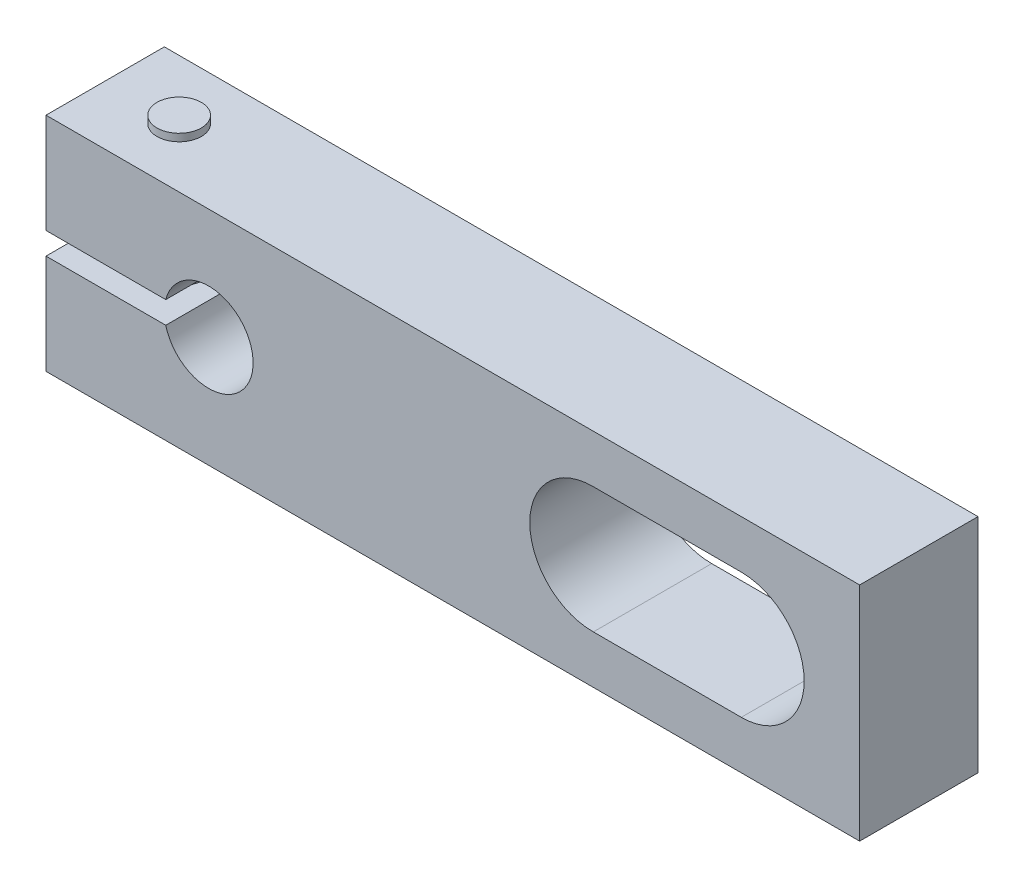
ISO-10303-21;
HEADER;
FILE_DESCRIPTION(('STEP AP214'),'2;1');
FILE_NAME('part.step','',(''),(''),'','','');
FILE_SCHEMA(('AUTOMOTIVE_DESIGN { 1 0 10303 214 1 1 1 1 }'));
ENDSEC;
DATA;
#1=APPLICATION_CONTEXT('core data for automotive mechanical design processes');
#2=APPLICATION_PROTOCOL_DEFINITION('international standard','automotive_design',2000,#1);
#3=PRODUCT_CONTEXT('',#1,'mechanical');
#4=PRODUCT('Part','Part','',(#3));
#5=PRODUCT_RELATED_PRODUCT_CATEGORY('part','',(#4));
#6=PRODUCT_DEFINITION_FORMATION('','',#4);
#7=PRODUCT_DEFINITION_CONTEXT('part definition',#1,'design');
#8=PRODUCT_DEFINITION('design','',#6,#7);
#9=PRODUCT_DEFINITION_SHAPE('','',#8);
#10=(LENGTH_UNIT() NAMED_UNIT(*) SI_UNIT(.MILLI.,.METRE.));
#11=(NAMED_UNIT(*) PLANE_ANGLE_UNIT() SI_UNIT($,.RADIAN.));
#12=(NAMED_UNIT(*) SI_UNIT($,.STERADIAN.) SOLID_ANGLE_UNIT());
#13=UNCERTAINTY_MEASURE_WITH_UNIT(LENGTH_MEASURE(1.E-05),#10,'distance_accuracy_value','');
#14=(GEOMETRIC_REPRESENTATION_CONTEXT(3) GLOBAL_UNCERTAINTY_ASSIGNED_CONTEXT((#13)) GLOBAL_UNIT_ASSIGNED_CONTEXT((#10,
#11,#12)) REPRESENTATION_CONTEXT('',''));
#15=CARTESIAN_POINT('',(0.,0.,0.));
#16=DIRECTION('',(0.,0.,1.));
#17=DIRECTION('',(1.,0.,0.));
#18=AXIS2_PLACEMENT_3D('',#15,#16,#17);
#19=CARTESIAN_POINT('',(-22.5,-4.,-4.));
#20=DIRECTION('',(0.,-1.,0.));
#21=DIRECTION('',(-0.406889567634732,0.,-0.91347735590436));
#22=AXIS2_PLACEMENT_3D('',#19,#20,#21);
#23=CYLINDRICAL_SURFACE('',#22,1.5);
#24=CARTESIAN_POINT('',(-22.5,-4.,-4.));
#25=DIRECTION('',(0.,-1.,0.));
#26=DIRECTION('',(-0.406889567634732,0.,-0.91347735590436));
#27=AXIS2_PLACEMENT_3D('',#24,#25,#26);
#28=CIRCLE('',#27,1.5);
#29=CARTESIAN_POINT('',(-23.1103343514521,-4.,-5.37021603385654));
#30=VERTEX_POINT('',#29);
#31=EDGE_CURVE('E266',#30,#30,#28,.F.);
#32=ORIENTED_EDGE('',*,*,#31,.T.);
#33=EDGE_LOOP('',(#32));
#34=FACE_BOUND('',#33,.T.);
#35=CARTESIAN_POINT('',(-22.5,0.75,-4.));
#36=DIRECTION('',(0.,1.,0.));
#37=DIRECTION('',(-1.,0.,0.));
#38=AXIS2_PLACEMENT_3D('',#35,#36,#37);
#39=CIRCLE('',#38,1.5);
#40=CARTESIAN_POINT('',(-24.,0.75,-4.));
#41=VERTEX_POINT('',#40);
#42=EDGE_CURVE('E27',#41,#41,#39,.F.);
#43=ORIENTED_EDGE('',*,*,#42,.T.);
#44=EDGE_LOOP('',(#43));
#45=FACE_BOUND('',#44,.T.);
#46=ADVANCED_FACE('F17',(#34,#45),#23,.T.);
#47=CARTESIAN_POINT('',(-21.1297839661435,-4.,-4.61033435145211));
#48=DIRECTION('',(0.,-1.,0.));
#49=DIRECTION('',(-0.406889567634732,0.,-0.91347735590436));
#50=AXIS2_PLACEMENT_3D('',#47,#48,#49);
#51=PLANE('',#50);
#52=ORIENTED_EDGE('',*,*,#31,.F.);
#53=EDGE_LOOP('',(#52));
#54=FACE_BOUND('',#53,.T.);
#55=CARTESIAN_POINT('',(-22.5,-4.,-4.));
#56=DIRECTION('',(0.,-1.,0.));
#57=DIRECTION('',(0.,0.,-1.));
#58=AXIS2_PLACEMENT_3D('',#55,#56,#57);
#59=CIRCLE('',#58,1.75);
#60=CARTESIAN_POINT('',(-22.5,-4.,-5.75));
#61=VERTEX_POINT('',#60);
#62=EDGE_CURVE('E260',#61,#61,#59,.T.);
#63=ORIENTED_EDGE('',*,*,#62,.F.);
#64=EDGE_LOOP('',(#63));
#65=FACE_BOUND('',#64,.T.);
#66=ADVANCED_FACE('F438',(#54,#65),#51,.F.);
#67=CARTESIAN_POINT('',(-21.9127054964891,-4.87,-2.68150900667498));
#68=DIRECTION('',(0.,-1.,0.));
#69=DIRECTION('',(-0.406889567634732,0.,-0.91347735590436));
#70=AXIS2_PLACEMENT_3D('',#67,#68,#69);
#71=PLANE('',#70);
#72=DIRECTION('',(0.587649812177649,0.,-0.809115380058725));
#73=VECTOR('',#72,1.);
#74=CARTESIAN_POINT('',(-23.9354939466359,-4.87,-4.1506335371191));
#75=LINE('',#74,#73);
#76=CARTESIAN_POINT('',(-23.9354939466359,-4.87,-4.1506335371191));
#77=VERTEX_POINT('',#76);
#78=CARTESIAN_POINT('',(-23.0872945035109,-4.87,-5.31849099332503));
#79=VERTEX_POINT('',#78);
#80=EDGE_CURVE('E277',#77,#79,#75,.T.);
#81=ORIENTED_EDGE('',*,*,#80,.T.);
#82=DIRECTION('',(-0.994539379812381,0.,-0.104361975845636));
#83=VECTOR('',#82,1.);
#84=CARTESIAN_POINT('',(-21.651800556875,-4.87,-5.16785745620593));
#85=LINE('',#84,#83);
#86=CARTESIAN_POINT('',(-21.651800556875,-4.87,-5.16785745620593));
#87=VERTEX_POINT('',#86);
#88=EDGE_CURVE('E279',#87,#79,#85,.T.);
#89=ORIENTED_EDGE('',*,*,#88,.F.);
#90=DIRECTION('',(-0.406889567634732,0.,-0.91347735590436));
#91=VECTOR('',#90,1.);
#92=CARTESIAN_POINT('',(-20.7708588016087,-4.87,-3.19012096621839));
#93=LINE('',#92,#91);
#94=CARTESIAN_POINT('',(-21.0645060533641,-4.87,-3.84936646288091));
#95=VERTEX_POINT('',#94);
#96=EDGE_CURVE('E295',#87,#95,#93,.F.);
#97=ORIENTED_EDGE('',*,*,#96,.T.);
#98=DIRECTION('',(-0.587649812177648,0.,0.809115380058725));
#99=VECTOR('',#98,1.);
#100=CARTESIAN_POINT('',(-21.0645060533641,-4.87,-3.84936646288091));
#101=LINE('',#100,#99);
#102=CARTESIAN_POINT('',(-21.9127054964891,-4.87,-2.68150900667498));
#103=VERTEX_POINT('',#102);
#104=EDGE_CURVE('E312',#95,#103,#101,.T.);
#105=ORIENTED_EDGE('',*,*,#104,.T.);
#106=DIRECTION('',(0.994539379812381,0.,0.104361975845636));
#107=VECTOR('',#106,1.);
#108=CARTESIAN_POINT('',(-23.348199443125,-4.87,-2.83214254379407));
#109=LINE('',#108,#107);
#110=CARTESIAN_POINT('',(-23.348199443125,-4.87,-2.83214254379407));
#111=VERTEX_POINT('',#110);
#112=EDGE_CURVE('E301',#111,#103,#109,.T.);
#113=ORIENTED_EDGE('',*,*,#112,.F.);
#114=DIRECTION('',(-0.406889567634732,0.,-0.91347735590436));
#115=VECTOR('',#114,1.);
#116=CARTESIAN_POINT('',(-23.0545521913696,-4.87,-2.17289704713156));
#117=LINE('',#116,#115);
#118=EDGE_CURVE('E298',#111,#77,#117,.T.);
#119=ORIENTED_EDGE('',*,*,#118,.T.);
#120=EDGE_LOOP('',(#81,#89,#97,#105,#113,#119));
#121=FACE_BOUND('',#120,.T.);
#122=ADVANCED_FACE('F332',(#121),#71,.T.);
#123=CARTESIAN_POINT('',(-21.0645060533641,-4.87,-3.84936646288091));
#124=DIRECTION('',(0.809115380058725,0.,0.587649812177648));
#125=DIRECTION('',(-0.587649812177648,0.,0.809115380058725));
#126=AXIS2_PLACEMENT_3D('',#123,#124,#125);
#127=PLANE('',#126);
#128=ORIENTED_EDGE('',*,*,#104,.F.);
#129=DIRECTION('',(0.,-1.,0.));
#130=VECTOR('',#129,1.);
#131=CARTESIAN_POINT('',(-21.0645060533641,-4.87,-3.84936646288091));
#132=LINE('',#131,#130);
#133=CARTESIAN_POINT('',(-21.0645060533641,-7.,-3.84936646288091));
#134=VERTEX_POINT('',#133);
#135=EDGE_CURVE('E310',#134,#95,#132,.F.);
#136=ORIENTED_EDGE('',*,*,#135,.F.);
#137=DIRECTION('',(-0.587649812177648,0.,0.809115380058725));
#138=VECTOR('',#137,1.);
#139=CARTESIAN_POINT('',(-21.0645060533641,-7.,-3.84936646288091));
#140=LINE('',#139,#138);
#141=CARTESIAN_POINT('',(-21.9127054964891,-7.,-2.68150900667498));
#142=VERTEX_POINT('',#141);
#143=EDGE_CURVE('E271',#134,#142,#140,.T.);
#144=ORIENTED_EDGE('',*,*,#143,.T.);
#145=DIRECTION('',(0.,-1.,0.));
#146=VECTOR('',#145,1.);
#147=CARTESIAN_POINT('',(-21.9127054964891,-4.87,-2.68150900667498));
#148=LINE('',#147,#146);
#149=EDGE_CURVE('E314',#103,#142,#148,.T.);
#150=ORIENTED_EDGE('',*,*,#149,.F.);
#151=EDGE_LOOP('',(#128,#136,#144,#150));
#152=FACE_BOUND('',#151,.T.);
#153=ADVANCED_FACE('F322',(#152),#127,.F.);
#154=CARTESIAN_POINT('',(-23.348199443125,-4.87,-2.83214254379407));
#155=DIRECTION('',(0.104361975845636,0.,-0.994539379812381));
#156=DIRECTION('',(0.994539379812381,0.,0.104361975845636));
#157=AXIS2_PLACEMENT_3D('',#154,#155,#156);
#158=PLANE('',#157);
#159=DIRECTION('',(0.994539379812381,0.,0.104361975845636));
#160=VECTOR('',#159,1.);
#161=CARTESIAN_POINT('',(-23.348199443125,-7.,-2.83214254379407));
#162=LINE('',#161,#160);
#163=CARTESIAN_POINT('',(-23.348199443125,-7.,-2.83214254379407));
#164=VERTEX_POINT('',#163);
#165=EDGE_CURVE('E304',#142,#164,#162,.F.);
#166=ORIENTED_EDGE('',*,*,#165,.T.);
#167=DIRECTION('',(0.,-1.,0.));
#168=VECTOR('',#167,1.);
#169=CARTESIAN_POINT('',(-23.348199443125,-4.87,-2.83214254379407));
#170=LINE('',#169,#168);
#171=EDGE_CURVE('E307',#164,#111,#170,.F.);
#172=ORIENTED_EDGE('',*,*,#171,.T.);
#173=ORIENTED_EDGE('',*,*,#112,.T.);
#174=ORIENTED_EDGE('',*,*,#149,.T.);
#175=EDGE_LOOP('',(#166,#172,#173,#174));
#176=FACE_BOUND('',#175,.T.);
#177=ADVANCED_FACE('F329',(#176),#158,.T.);
#178=CARTESIAN_POINT('',(-23.348199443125,-4.87,-2.83214254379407));
#179=DIRECTION('',(-0.91347735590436,0.,0.406889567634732));
#180=DIRECTION('',(-0.406889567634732,0.,-0.91347735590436));
#181=AXIS2_PLACEMENT_3D('',#178,#179,#180);
#182=PLANE('',#181);
#183=ORIENTED_EDGE('',*,*,#118,.F.);
#184=ORIENTED_EDGE('',*,*,#171,.F.);
#185=DIRECTION('',(-0.406889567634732,0.,-0.91347735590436));
#186=VECTOR('',#185,1.);
#187=CARTESIAN_POINT('',(-23.348199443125,-7.,-2.83214254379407));
#188=LINE('',#187,#186);
#189=CARTESIAN_POINT('',(-23.9354939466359,-7.,-4.1506335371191));
#190=VERTEX_POINT('',#189);
#191=EDGE_CURVE('E287',#190,#164,#188,.F.);
#192=ORIENTED_EDGE('',*,*,#191,.F.);
#193=DIRECTION('',(0.,-1.,0.));
#194=VECTOR('',#193,1.);
#195=CARTESIAN_POINT('',(-23.9354939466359,-4.87,-4.1506335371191));
#196=LINE('',#195,#194);
#197=EDGE_CURVE('E289',#77,#190,#196,.T.);
#198=ORIENTED_EDGE('',*,*,#197,.F.);
#199=EDGE_LOOP('',(#183,#184,#192,#198));
#200=FACE_BOUND('',#199,.T.);
#201=ADVANCED_FACE('F343',(#200),#182,.F.);
#202=CARTESIAN_POINT('',(-23.9354939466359,-4.87,-4.1506335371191));
#203=DIRECTION('',(-0.809115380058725,0.,-0.587649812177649));
#204=DIRECTION('',(0.587649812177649,0.,-0.809115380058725));
#205=AXIS2_PLACEMENT_3D('',#202,#203,#204);
#206=PLANE('',#205);
#207=ORIENTED_EDGE('',*,*,#80,.F.);
#208=ORIENTED_EDGE('',*,*,#197,.T.);
#209=DIRECTION('',(0.587649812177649,0.,-0.809115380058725));
#210=VECTOR('',#209,1.);
#211=CARTESIAN_POINT('',(-23.9354939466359,-7.,-4.1506335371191));
#212=LINE('',#211,#210);
#213=CARTESIAN_POINT('',(-23.0872945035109,-7.,-5.31849099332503));
#214=VERTEX_POINT('',#213);
#215=EDGE_CURVE('E169',#214,#190,#212,.F.);
#216=ORIENTED_EDGE('',*,*,#215,.F.);
#217=DIRECTION('',(0.,-1.,0.));
#218=VECTOR('',#217,1.);
#219=CARTESIAN_POINT('',(-23.0872945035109,-4.87,-5.31849099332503));
#220=LINE('',#219,#218);
#221=EDGE_CURVE('E282',#79,#214,#220,.T.);
#222=ORIENTED_EDGE('',*,*,#221,.F.);
#223=EDGE_LOOP('',(#207,#208,#216,#222));
#224=FACE_BOUND('',#223,.T.);
#225=ADVANCED_FACE('F341',(#224),#206,.F.);
#226=CARTESIAN_POINT('',(-21.651800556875,-4.87,-5.16785745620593));
#227=DIRECTION('',(-0.104361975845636,0.,0.994539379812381));
#228=DIRECTION('',(-0.994539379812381,0.,-0.104361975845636));
#229=AXIS2_PLACEMENT_3D('',#226,#227,#228);
#230=PLANE('',#229);
#231=DIRECTION('',(-0.994539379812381,0.,-0.104361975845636));
#232=VECTOR('',#231,1.);
#233=CARTESIAN_POINT('',(-21.651800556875,-7.,-5.16785745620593));
#234=LINE('',#233,#232);
#235=CARTESIAN_POINT('',(-21.651800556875,-7.,-5.16785745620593));
#236=VERTEX_POINT('',#235);
#237=EDGE_CURVE('E285',#214,#236,#234,.F.);
#238=ORIENTED_EDGE('',*,*,#237,.T.);
#239=DIRECTION('',(0.,-1.,0.));
#240=VECTOR('',#239,1.);
#241=CARTESIAN_POINT('',(-21.651800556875,-4.87,-5.16785745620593));
#242=LINE('',#241,#240);
#243=EDGE_CURVE('E292',#87,#236,#242,.T.);
#244=ORIENTED_EDGE('',*,*,#243,.F.);
#245=ORIENTED_EDGE('',*,*,#88,.T.);
#246=ORIENTED_EDGE('',*,*,#221,.T.);
#247=EDGE_LOOP('',(#238,#244,#245,#246));
#248=FACE_BOUND('',#247,.T.);
#249=ADVANCED_FACE('F337',(#248),#230,.T.);
#250=CARTESIAN_POINT('',(-21.0645060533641,-4.87,-3.84936646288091));
#251=DIRECTION('',(-0.91347735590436,0.,0.406889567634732));
#252=DIRECTION('',(-0.406889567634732,0.,-0.91347735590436));
#253=AXIS2_PLACEMENT_3D('',#250,#251,#252);
#254=PLANE('',#253);
#255=DIRECTION('',(-0.406889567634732,0.,-0.91347735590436));
#256=VECTOR('',#255,1.);
#257=CARTESIAN_POINT('',(-21.0645060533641,-7.,-3.84936646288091));
#258=LINE('',#257,#256);
#259=EDGE_CURVE('E36',#236,#134,#258,.F.);
#260=ORIENTED_EDGE('',*,*,#259,.T.);
#261=ORIENTED_EDGE('',*,*,#135,.T.);
#262=ORIENTED_EDGE('',*,*,#96,.F.);
#263=ORIENTED_EDGE('',*,*,#243,.T.);
#264=EDGE_LOOP('',(#260,#261,#262,#263));
#265=FACE_BOUND('',#264,.T.);
#266=ADVANCED_FACE('F335',(#265),#254,.T.);
#267=CARTESIAN_POINT('',(-20.0792850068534,-7.,-5.07825735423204));
#268=DIRECTION('',(0.,1.,0.));
#269=DIRECTION('',(0.406889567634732,0.,0.91347735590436));
#270=AXIS2_PLACEMENT_3D('',#267,#268,#269);
#271=PLANE('',#270);
#272=CARTESIAN_POINT('',(-22.5,-7.,-4.));
#273=DIRECTION('',(0.,1.,0.));
#274=DIRECTION('',(0.406889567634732,0.,0.91347735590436));
#275=AXIS2_PLACEMENT_3D('',#272,#273,#274);
#276=CIRCLE('',#275,2.75);
#277=CARTESIAN_POINT('',(-21.3810536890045,-7.,-1.48793727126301));
#278=VERTEX_POINT('',#277);
#279=EDGE_CURVE('E267',#278,#278,#276,.T.);
#280=ORIENTED_EDGE('',*,*,#279,.F.);
#281=EDGE_LOOP('',(#280));
#282=FACE_BOUND('',#281,.T.);
#283=ORIENTED_EDGE('',*,*,#259,.F.);
#284=ORIENTED_EDGE('',*,*,#237,.F.);
#285=ORIENTED_EDGE('',*,*,#215,.T.);
#286=ORIENTED_EDGE('',*,*,#191,.T.);
#287=ORIENTED_EDGE('',*,*,#165,.F.);
#288=ORIENTED_EDGE('',*,*,#143,.F.);
#289=EDGE_LOOP('',(#283,#284,#285,#286,#287,#288));
#290=FACE_BOUND('',#289,.T.);
#291=ADVANCED_FACE('F324',(#282,#290),#271,.F.);
#292=CARTESIAN_POINT('',(-22.5,-4.,-4.));
#293=DIRECTION('',(0.,-1.,0.));
#294=DIRECTION('',(-0.406889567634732,0.,-0.91347735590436));
#295=AXIS2_PLACEMENT_3D('',#292,#293,#294);
#296=CYLINDRICAL_SURFACE('',#295,2.75);
#297=ORIENTED_EDGE('',*,*,#279,.T.);
#298=EDGE_LOOP('',(#297));
#299=FACE_BOUND('',#298,.T.);
#300=CARTESIAN_POINT('',(-22.5,-4.,-4.));
#301=DIRECTION('',(0.,-1.,0.));
#302=DIRECTION('',(-0.406889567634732,0.,-0.91347735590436));
#303=AXIS2_PLACEMENT_3D('',#300,#301,#302);
#304=CIRCLE('',#303,2.75);
#305=CARTESIAN_POINT('',(-23.6189463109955,-4.,-6.51206272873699));
#306=VERTEX_POINT('',#305);
#307=EDGE_CURVE('E270',#306,#306,#304,.T.);
#308=ORIENTED_EDGE('',*,*,#307,.T.);
#309=EDGE_LOOP('',(#308));
#310=FACE_BOUND('',#309,.T.);
#311=ADVANCED_FACE('F423',(#299,#310),#296,.T.);
#312=CARTESIAN_POINT('',(-22.5,8.,-4.));
#313=DIRECTION('',(0.,-1.,0.));
#314=DIRECTION('',(-0.406889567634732,0.,-0.91347735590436));
#315=AXIS2_PLACEMENT_3D('',#312,#313,#314);
#316=PLANE('',#315);
#317=CARTESIAN_POINT('',(-22.5,8.,-4.));
#318=DIRECTION('',(0.,-1.,0.));
#319=DIRECTION('',(-0.406889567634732,0.,-0.91347735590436));
#320=AXIS2_PLACEMENT_3D('',#317,#318,#319);
#321=CIRCLE('',#320,1.5);
#322=CARTESIAN_POINT('',(-23.1103343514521,8.,-5.37021603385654));
#323=VERTEX_POINT('',#322);
#324=EDGE_CURVE('E263',#323,#323,#321,.T.);
#325=ORIENTED_EDGE('',*,*,#324,.F.);
#326=EDGE_LOOP('',(#325));
#327=FACE_BOUND('',#326,.T.);
#328=ADVANCED_FACE('F367',(#327),#316,.F.);
#329=CARTESIAN_POINT('',(-22.5,7.5,-4.));
#330=DIRECTION('',(0.,1.,0.));
#331=DIRECTION('',(0.,0.,1.));
#332=AXIS2_PLACEMENT_3D('',#329,#330,#331);
#333=CIRCLE('',#332,1.5);
#334=CARTESIAN_POINT('',(-22.5,7.5,-2.5));
#335=VERTEX_POINT('',#334);
#336=EDGE_CURVE('E11',#335,#335,#333,.F.);
#337=ORIENTED_EDGE('',*,*,#336,.F.);
#338=EDGE_LOOP('',(#337));
#339=FACE_BOUND('',#338,.T.);
#340=ORIENTED_EDGE('',*,*,#324,.T.);
#341=EDGE_LOOP('',(#340));
#342=FACE_BOUND('',#341,.T.);
#343=ADVANCED_FACE('F358',(#339,#342),#23,.T.);
#344=CARTESIAN_POINT('',(9.45283439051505,0.,-8.));
#345=DIRECTION('',(0.,0.,1.));
#346=DIRECTION('',(1.,0.,0.));
#347=AXIS2_PLACEMENT_3D('',#344,#345,#346);
#348=CYLINDRICAL_SURFACE('',#347,4.25026170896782);
#349=DIRECTION('',(0.,0.,1.));
#350=VECTOR('',#349,1.);
#351=CARTESIAN_POINT('',(9.49999999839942,-4.25000000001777,-8.));
#352=LINE('',#351,#350);
#353=CARTESIAN_POINT('',(9.49999999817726,-4.25000000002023,-8.));
#354=VERTEX_POINT('',#353);
#355=CARTESIAN_POINT('',(9.49999999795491,-4.25,0.));
#356=VERTEX_POINT('',#355);
#357=EDGE_CURVE('E146',#354,#356,#352,.T.);
#358=ORIENTED_EDGE('',*,*,#357,.F.);
#359=CARTESIAN_POINT('',(9.45283439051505,0.,-8.));
#360=DIRECTION('',(0.,0.,1.));
#361=DIRECTION('',(1.,0.,0.));
#362=AXIS2_PLACEMENT_3D('',#359,#360,#361);
#363=CIRCLE('',#362,4.25026170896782);
#364=CARTESIAN_POINT('',(9.49999999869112,4.25,-8.));
#365=VERTEX_POINT('',#364);
#366=EDGE_CURVE('E178',#365,#354,#363,.T.);
#367=ORIENTED_EDGE('',*,*,#366,.F.);
#368=DIRECTION('',(0.,0.,1.));
#369=VECTOR('',#368,1.);
#370=CARTESIAN_POINT('',(9.5000000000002,4.25,-8.));
#371=LINE('',#370,#369);
#372=CARTESIAN_POINT('',(9.5000000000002,4.25,0.));
#373=VERTEX_POINT('',#372);
#374=EDGE_CURVE('E157',#373,#365,#371,.F.);
#375=ORIENTED_EDGE('',*,*,#374,.F.);
#376=CARTESIAN_POINT('',(9.45283439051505,0.,0.));
#377=DIRECTION('',(0.,0.,-1.));
#378=DIRECTION('',(-1.,0.,0.));
#379=AXIS2_PLACEMENT_3D('',#376,#377,#378);
#380=CIRCLE('',#379,4.25026170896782);
#381=EDGE_CURVE('E163',#356,#373,#380,.T.);
#382=ORIENTED_EDGE('',*,*,#381,.F.);
#383=EDGE_LOOP('',(#358,#367,#375,#382));
#384=FACE_BOUND('',#383,.T.);
#385=ADVANCED_FACE('F166',(#384),#348,.F.);
#386=CARTESIAN_POINT('',(19.5,4.25,-8.));
#387=DIRECTION('',(0.,1.,0.));
#388=DIRECTION('',(-1.,0.,0.));
#389=AXIS2_PLACEMENT_3D('',#386,#387,#388);
#390=PLANE('',#389);
#391=ORIENTED_EDGE('',*,*,#374,.T.);
#392=DIRECTION('',(-1.,0.,0.));
#393=VECTOR('',#392,1.);
#394=CARTESIAN_POINT('',(-27.5,4.25,-8.));
#395=LINE('',#394,#393);
#396=CARTESIAN_POINT('',(19.5,4.25,-8.));
#397=VERTEX_POINT('',#396);
#398=EDGE_CURVE('E180',#397,#365,#395,.T.);
#399=ORIENTED_EDGE('',*,*,#398,.F.);
#400=DIRECTION('',(0.,0.,1.));
#401=VECTOR('',#400,1.);
#402=CARTESIAN_POINT('',(19.5,4.25,-8.));
#403=LINE('',#402,#401);
#404=CARTESIAN_POINT('',(19.5,4.25,0.));
#405=VERTEX_POINT('',#404);
#406=EDGE_CURVE('E251',#397,#405,#403,.T.);
#407=ORIENTED_EDGE('',*,*,#406,.T.);
#408=DIRECTION('',(1.,0.,0.));
#409=VECTOR('',#408,1.);
#410=CARTESIAN_POINT('',(-27.5,4.25,0.));
#411=LINE('',#410,#409);
#412=EDGE_CURVE('E172',#373,#405,#411,.T.);
#413=ORIENTED_EDGE('',*,*,#412,.F.);
#414=EDGE_LOOP('',(#391,#399,#407,#413));
#415=FACE_BOUND('',#414,.T.);
#416=ADVANCED_FACE('F357',(#415),#390,.F.);
#417=CARTESIAN_POINT('',(19.5,0.,-8.));
#418=DIRECTION('',(0.,0.,1.));
#419=DIRECTION('',(1.,0.,0.));
#420=AXIS2_PLACEMENT_3D('',#417,#418,#419);
#421=CYLINDRICAL_SURFACE('',#420,4.25);
#422=ORIENTED_EDGE('',*,*,#406,.F.);
#423=CARTESIAN_POINT('',(19.5,0.,-8.));
#424=DIRECTION('',(0.,0.,1.));
#425=DIRECTION('',(1.,0.,0.));
#426=AXIS2_PLACEMENT_3D('',#423,#424,#425);
#427=CIRCLE('',#426,4.25);
#428=CARTESIAN_POINT('',(19.5,-4.25,-8.));
#429=VERTEX_POINT('',#428);
#430=EDGE_CURVE('E174',#429,#397,#427,.T.);
#431=ORIENTED_EDGE('',*,*,#430,.F.);
#432=DIRECTION('',(0.,0.,1.));
#433=VECTOR('',#432,1.);
#434=CARTESIAN_POINT('',(19.5,-4.25,-8.));
#435=LINE('',#434,#433);
#436=CARTESIAN_POINT('',(19.5,-4.25,0.));
#437=VERTEX_POINT('',#436);
#438=EDGE_CURVE('E140',#429,#437,#435,.T.);
#439=ORIENTED_EDGE('',*,*,#438,.T.);
#440=CARTESIAN_POINT('',(19.5,0.,0.));
#441=DIRECTION('',(0.,0.,-1.));
#442=DIRECTION('',(-1.,0.,0.));
#443=AXIS2_PLACEMENT_3D('',#440,#441,#442);
#444=CIRCLE('',#443,4.25);
#445=EDGE_CURVE('E164',#405,#437,#444,.T.);
#446=ORIENTED_EDGE('',*,*,#445,.F.);
#447=EDGE_LOOP('',(#422,#431,#439,#446));
#448=FACE_BOUND('',#447,.T.);
#449=ADVANCED_FACE('F364',(#448),#421,.F.);
#450=CARTESIAN_POINT('',(19.5,-4.25,-8.));
#451=DIRECTION('',(0.,-1.,0.));
#452=DIRECTION('',(1.,0.,0.));
#453=AXIS2_PLACEMENT_3D('',#450,#451,#452);
#454=PLANE('',#453);
#455=ORIENTED_EDGE('',*,*,#438,.F.);
#456=DIRECTION('',(1.,0.,0.));
#457=VECTOR('',#456,1.);
#458=CARTESIAN_POINT('',(-27.5,-4.25,-8.));
#459=LINE('',#458,#457);
#460=EDGE_CURVE('E151',#354,#429,#459,.T.);
#461=ORIENTED_EDGE('',*,*,#460,.F.);
#462=ORIENTED_EDGE('',*,*,#357,.T.);
#463=DIRECTION('',(-1.,0.,0.));
#464=VECTOR('',#463,1.);
#465=CARTESIAN_POINT('',(-27.5,-4.25,0.));
#466=LINE('',#465,#464);
#467=EDGE_CURVE('E149',#437,#356,#466,.T.);
#468=ORIENTED_EDGE('',*,*,#467,.F.);
#469=EDGE_LOOP('',(#455,#461,#462,#468));
#470=FACE_BOUND('',#469,.T.);
#471=ADVANCED_FACE('F148',(#470),#454,.F.);
#472=CARTESIAN_POINT('',(-27.5,-7.5,0.));
#473=DIRECTION('',(0.,1.,0.));
#474=DIRECTION('',(0.,0.,1.));
#475=AXIS2_PLACEMENT_3D('',#472,#473,#474);
#476=PLANE('',#475);
#477=CARTESIAN_POINT('',(-22.5,-7.5,-4.));
#478=DIRECTION('',(0.,1.,0.));
#479=DIRECTION('',(0.,0.,1.));
#480=AXIS2_PLACEMENT_3D('',#477,#478,#479);
#481=CIRCLE('',#480,3.);
#482=CARTESIAN_POINT('',(-22.5,-7.5,-1.));
#483=VERTEX_POINT('',#482);
#484=EDGE_CURVE('E21',#483,#483,#481,.T.);
#485=ORIENTED_EDGE('',*,*,#484,.T.);
#486=EDGE_LOOP('',(#485));
#487=FACE_BOUND('',#486,.T.);
#488=DIRECTION('',(0.,0.,-1.));
#489=VECTOR('',#488,1.);
#490=CARTESIAN_POINT('',(27.5,-7.5,-8.));
#491=LINE('',#490,#489);
#492=CARTESIAN_POINT('',(27.5,-7.5,0.));
#493=VERTEX_POINT('',#492);
#494=CARTESIAN_POINT('',(27.5,-7.5,-8.));
#495=VERTEX_POINT('',#494);
#496=EDGE_CURVE('E207',#493,#495,#491,.T.);
#497=ORIENTED_EDGE('',*,*,#496,.F.);
#498=DIRECTION('',(-1.,0.,0.));
#499=VECTOR('',#498,1.);
#500=CARTESIAN_POINT('',(-27.5,-7.5,0.));
#501=LINE('',#500,#499);
#502=CARTESIAN_POINT('',(-27.5,-7.5,0.));
#503=VERTEX_POINT('',#502);
#504=EDGE_CURVE('E239',#503,#493,#501,.F.);
#505=ORIENTED_EDGE('',*,*,#504,.F.);
#506=DIRECTION('',(0.,0.,1.));
#507=VECTOR('',#506,1.);
#508=CARTESIAN_POINT('',(-27.5,-7.5,-8.));
#509=LINE('',#508,#507);
#510=CARTESIAN_POINT('',(-27.5,-7.5,-8.));
#511=VERTEX_POINT('',#510);
#512=EDGE_CURVE('E219',#511,#503,#509,.T.);
#513=ORIENTED_EDGE('',*,*,#512,.F.);
#514=DIRECTION('',(-1.,0.,0.));
#515=VECTOR('',#514,1.);
#516=CARTESIAN_POINT('',(-27.5,-7.5,-8.));
#517=LINE('',#516,#515);
#518=EDGE_CURVE('E236',#511,#495,#517,.F.);
#519=ORIENTED_EDGE('',*,*,#518,.T.);
#520=EDGE_LOOP('',(#497,#505,#513,#519));
#521=FACE_BOUND('',#520,.T.);
#522=ADVANCED_FACE('F373',(#487,#521),#476,.F.);
#523=CARTESIAN_POINT('',(-22.5,-7.5,-4.));
#524=DIRECTION('',(0.,-1.,0.));
#525=DIRECTION('',(0.,0.,-1.));
#526=AXIS2_PLACEMENT_3D('',#523,#524,#525);
#527=CYLINDRICAL_SURFACE('',#526,3.);
#528=CARTESIAN_POINT('',(-22.5,-4.,-4.));
#529=DIRECTION('',(0.,-1.,0.));
#530=DIRECTION('',(0.,0.,-1.));
#531=AXIS2_PLACEMENT_3D('',#528,#529,#530);
#532=CIRCLE('',#531,3.);
#533=CARTESIAN_POINT('',(-22.5,-4.,-7.));
#534=VERTEX_POINT('',#533);
#535=EDGE_CURVE('E244',#534,#534,#532,.T.);
#536=ORIENTED_EDGE('',*,*,#535,.F.);
#537=EDGE_LOOP('',(#536));
#538=FACE_BOUND('',#537,.T.);
#539=ORIENTED_EDGE('',*,*,#484,.F.);
#540=EDGE_LOOP('',(#539));
#541=FACE_BOUND('',#540,.T.);
#542=ADVANCED_FACE('F19',(#538,#541),#527,.F.);
#543=CARTESIAN_POINT('',(-20.75,-4.,-4.));
#544=DIRECTION('',(0.,1.,0.));
#545=DIRECTION('',(0.,0.,1.));
#546=AXIS2_PLACEMENT_3D('',#543,#544,#545);
#547=PLANE('',#546);
#548=ORIENTED_EDGE('',*,*,#307,.F.);
#549=EDGE_LOOP('',(#548));
#550=FACE_BOUND('',#549,.T.);
#551=ORIENTED_EDGE('',*,*,#535,.T.);
#552=EDGE_LOOP('',(#551));
#553=FACE_BOUND('',#552,.T.);
#554=ADVANCED_FACE('F403',(#550,#553),#547,.F.);
#555=CARTESIAN_POINT('',(27.5,7.5,-8.));
#556=DIRECTION('',(-1.,0.,0.));
#557=DIRECTION('',(0.,0.,1.));
#558=AXIS2_PLACEMENT_3D('',#555,#556,#557);
#559=PLANE('',#558);
#560=DIRECTION('',(0.,0.,-1.));
#561=VECTOR('',#560,1.);
#562=CARTESIAN_POINT('',(27.5,7.5,-8.));
#563=LINE('',#562,#561);
#564=CARTESIAN_POINT('',(27.5,7.5,0.));
#565=VERTEX_POINT('',#564);
#566=CARTESIAN_POINT('',(27.5,7.5,-8.));
#567=VERTEX_POINT('',#566);
#568=EDGE_CURVE('E202',#565,#567,#563,.T.);
#569=ORIENTED_EDGE('',*,*,#568,.F.);
#570=DIRECTION('',(0.,-1.,0.));
#571=VECTOR('',#570,1.);
#572=CARTESIAN_POINT('',(27.5,7.5,0.));
#573=LINE('',#572,#571);
#574=EDGE_CURVE('E199',#565,#493,#573,.T.);
#575=ORIENTED_EDGE('',*,*,#574,.T.);
#576=ORIENTED_EDGE('',*,*,#496,.T.);
#577=DIRECTION('',(0.,1.,0.));
#578=VECTOR('',#577,1.);
#579=CARTESIAN_POINT('',(27.5,7.5,-8.));
#580=LINE('',#579,#578);
#581=EDGE_CURVE('E204',#495,#567,#580,.T.);
#582=ORIENTED_EDGE('',*,*,#581,.T.);
#583=EDGE_LOOP('',(#569,#575,#576,#582));
#584=FACE_BOUND('',#583,.T.);
#585=ADVANCED_FACE('F379',(#584),#559,.F.);
#586=CARTESIAN_POINT('',(-27.5,7.5,0.));
#587=DIRECTION('',(0.,0.,-1.));
#588=DIRECTION('',(-1.,0.,0.));
#589=AXIS2_PLACEMENT_3D('',#586,#587,#588);
#590=PLANE('',#589);
#591=DIRECTION('',(0.,1.,0.));
#592=VECTOR('',#591,1.);
#593=CARTESIAN_POINT('',(-27.5,7.5,0.));
#594=LINE('',#593,#592);
#595=CARTESIAN_POINT('',(-27.5,0.75,0.));
#596=VERTEX_POINT('',#595);
#597=CARTESIAN_POINT('',(-27.5,7.5,0.));
#598=VERTEX_POINT('',#597);
#599=EDGE_CURVE('E191',#596,#598,#594,.T.);
#600=ORIENTED_EDGE('',*,*,#599,.F.);
#601=DIRECTION('',(-1.,0.,0.));
#602=VECTOR('',#601,1.);
#603=CARTESIAN_POINT('',(-27.5,0.75,0.));
#604=LINE('',#603,#602);
#605=CARTESIAN_POINT('',(-19.4047375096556,0.75,0.));
#606=VERTEX_POINT('',#605);
#607=EDGE_CURVE('E230',#596,#606,#604,.F.);
#608=ORIENTED_EDGE('',*,*,#607,.T.);
#609=CARTESIAN_POINT('',(-16.5,0.,0.));
#610=DIRECTION('',(0.,0.,-1.));
#611=DIRECTION('',(-1.,0.,0.));
#612=AXIS2_PLACEMENT_3D('',#609,#610,#611);
#613=CIRCLE('',#612,3.);
#614=CARTESIAN_POINT('',(-19.4047375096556,-0.75,0.));
#615=VERTEX_POINT('',#614);
#616=EDGE_CURVE('E183',#615,#606,#613,.F.);
#617=ORIENTED_EDGE('',*,*,#616,.F.);
#618=DIRECTION('',(-1.,0.,0.));
#619=VECTOR('',#618,1.);
#620=CARTESIAN_POINT('',(-27.5,-0.75,0.));
#621=LINE('',#620,#619);
#622=CARTESIAN_POINT('',(-27.5,-0.75,0.));
#623=VERTEX_POINT('',#622);
#624=EDGE_CURVE('E233',#623,#615,#621,.F.);
#625=ORIENTED_EDGE('',*,*,#624,.F.);
#626=DIRECTION('',(0.,1.,0.));
#627=VECTOR('',#626,1.);
#628=CARTESIAN_POINT('',(-27.5,7.5,0.));
#629=LINE('',#628,#627);
#630=EDGE_CURVE('E213',#503,#623,#629,.T.);
#631=ORIENTED_EDGE('',*,*,#630,.F.);
#632=ORIENTED_EDGE('',*,*,#504,.T.);
#633=ORIENTED_EDGE('',*,*,#574,.F.);
#634=DIRECTION('',(-1.,0.,0.));
#635=VECTOR('',#634,1.);
#636=CARTESIAN_POINT('',(-27.5,7.5,0.));
#637=LINE('',#636,#635);
#638=EDGE_CURVE('E221',#565,#598,#637,.T.);
#639=ORIENTED_EDGE('',*,*,#638,.T.);
#640=EDGE_LOOP('',(#600,#608,#617,#625,#631,#632,#633,#639));
#641=FACE_BOUND('',#640,.T.);
#642=ORIENTED_EDGE('',*,*,#467,.T.);
#643=ORIENTED_EDGE('',*,*,#381,.T.);
#644=ORIENTED_EDGE('',*,*,#412,.T.);
#645=ORIENTED_EDGE('',*,*,#445,.T.);
#646=EDGE_LOOP('',(#642,#643,#644,#645));
#647=FACE_BOUND('',#646,.T.);
#648=ADVANCED_FACE('F161',(#641,#647),#590,.F.);
#649=CARTESIAN_POINT('',(-16.5,0.,-8.));
#650=DIRECTION('',(0.,0.,-1.));
#651=DIRECTION('',(-1.,0.,0.));
#652=AXIS2_PLACEMENT_3D('',#649,#650,#651);
#653=CYLINDRICAL_SURFACE('',#652,3.);
#654=DIRECTION('',(0.,0.,1.));
#655=VECTOR('',#654,1.);
#656=CARTESIAN_POINT('',(-19.404737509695,-0.75,0.));
#657=LINE('',#656,#655);
#658=CARTESIAN_POINT('',(-19.4047375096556,-0.75,-8.));
#659=VERTEX_POINT('',#658);
#660=EDGE_CURVE('E252',#659,#615,#657,.T.);
#661=ORIENTED_EDGE('',*,*,#660,.T.);
#662=ORIENTED_EDGE('',*,*,#616,.T.);
#663=DIRECTION('',(0.,0.,-1.));
#664=VECTOR('',#663,1.);
#665=CARTESIAN_POINT('',(-19.4047375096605,0.749999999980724,-8.));
#666=LINE('',#665,#664);
#667=CARTESIAN_POINT('',(-19.4047375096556,0.75,-8.));
#668=VERTEX_POINT('',#667);
#669=EDGE_CURVE('E247',#668,#606,#666,.F.);
#670=ORIENTED_EDGE('',*,*,#669,.F.);
#671=CARTESIAN_POINT('',(-16.5,0.,-8.));
#672=DIRECTION('',(0.,0.,1.));
#673=DIRECTION('',(1.,0.,0.));
#674=AXIS2_PLACEMENT_3D('',#671,#672,#673);
#675=CIRCLE('',#674,3.);
#676=EDGE_CURVE('E186',#668,#659,#675,.F.);
#677=ORIENTED_EDGE('',*,*,#676,.T.);
#678=EDGE_LOOP('',(#661,#662,#670,#677));
#679=FACE_BOUND('',#678,.T.);
#680=ADVANCED_FACE('F378',(#679),#653,.F.);
#681=CARTESIAN_POINT('',(-27.5,7.5,-8.));
#682=DIRECTION('',(0.,0.,1.));
#683=DIRECTION('',(1.,0.,0.));
#684=AXIS2_PLACEMENT_3D('',#681,#682,#683);
#685=PLANE('',#684);
#686=DIRECTION('',(0.,-1.,0.));
#687=VECTOR('',#686,1.);
#688=CARTESIAN_POINT('',(-27.5,7.5,-8.));
#689=LINE('',#688,#687);
#690=CARTESIAN_POINT('',(-27.5,7.5,-8.));
#691=VERTEX_POINT('',#690);
#692=CARTESIAN_POINT('',(-27.5,0.75,-8.));
#693=VERTEX_POINT('',#692);
#694=EDGE_CURVE('E196',#691,#693,#689,.T.);
#695=ORIENTED_EDGE('',*,*,#694,.F.);
#696=DIRECTION('',(1.,0.,0.));
#697=VECTOR('',#696,1.);
#698=CARTESIAN_POINT('',(-27.5,7.5,-8.));
#699=LINE('',#698,#697);
#700=EDGE_CURVE('E156',#691,#567,#699,.T.);
#701=ORIENTED_EDGE('',*,*,#700,.T.);
#702=ORIENTED_EDGE('',*,*,#581,.F.);
#703=ORIENTED_EDGE('',*,*,#518,.F.);
#704=DIRECTION('',(0.,-1.,0.));
#705=VECTOR('',#704,1.);
#706=CARTESIAN_POINT('',(-27.5,7.5,-8.));
#707=LINE('',#706,#705);
#708=CARTESIAN_POINT('',(-27.5,-0.75,-8.));
#709=VERTEX_POINT('',#708);
#710=EDGE_CURVE('E216',#709,#511,#707,.T.);
#711=ORIENTED_EDGE('',*,*,#710,.F.);
#712=DIRECTION('',(-1.,0.,0.));
#713=VECTOR('',#712,1.);
#714=CARTESIAN_POINT('',(-27.5,-0.75,-8.));
#715=LINE('',#714,#713);
#716=EDGE_CURVE('E224',#709,#659,#715,.F.);
#717=ORIENTED_EDGE('',*,*,#716,.T.);
#718=ORIENTED_EDGE('',*,*,#676,.F.);
#719=DIRECTION('',(-1.,0.,0.));
#720=VECTOR('',#719,1.);
#721=CARTESIAN_POINT('',(-27.5,0.75,-8.));
#722=LINE('',#721,#720);
#723=EDGE_CURVE('E227',#693,#668,#722,.F.);
#724=ORIENTED_EDGE('',*,*,#723,.F.);
#725=EDGE_LOOP('',(#695,#701,#702,#703,#711,#717,#718,#724));
#726=FACE_BOUND('',#725,.T.);
#727=ORIENTED_EDGE('',*,*,#460,.T.);
#728=ORIENTED_EDGE('',*,*,#430,.T.);
#729=ORIENTED_EDGE('',*,*,#398,.T.);
#730=ORIENTED_EDGE('',*,*,#366,.T.);
#731=EDGE_LOOP('',(#727,#728,#729,#730));
#732=FACE_BOUND('',#731,.T.);
#733=ADVANCED_FACE('F387',(#726,#732),#685,.F.);
#734=CARTESIAN_POINT('',(-27.5,7.5,-8.));
#735=DIRECTION('',(1.,0.,0.));
#736=DIRECTION('',(0.,0.,-1.));
#737=AXIS2_PLACEMENT_3D('',#734,#735,#736);
#738=PLANE('',#737);
#739=ORIENTED_EDGE('',*,*,#694,.T.);
#740=DIRECTION('',(0.,0.,1.));
#741=VECTOR('',#740,1.);
#742=CARTESIAN_POINT('',(-27.5,0.75,-8.));
#743=LINE('',#742,#741);
#744=EDGE_CURVE('E189',#693,#596,#743,.T.);
#745=ORIENTED_EDGE('',*,*,#744,.T.);
#746=ORIENTED_EDGE('',*,*,#599,.T.);
#747=DIRECTION('',(0.,0.,1.));
#748=VECTOR('',#747,1.);
#749=CARTESIAN_POINT('',(-27.5,7.5,-8.));
#750=LINE('',#749,#748);
#751=EDGE_CURVE('E194',#691,#598,#750,.T.);
#752=ORIENTED_EDGE('',*,*,#751,.F.);
#753=EDGE_LOOP('',(#739,#745,#746,#752));
#754=FACE_BOUND('',#753,.T.);
#755=ADVANCED_FACE('F385',(#754),#738,.F.);
#756=CARTESIAN_POINT('',(-27.5,0.75,0.));
#757=DIRECTION('',(0.,1.,0.));
#758=DIRECTION('',(-1.,0.,0.));
#759=AXIS2_PLACEMENT_3D('',#756,#757,#758);
#760=PLANE('',#759);
#761=ORIENTED_EDGE('',*,*,#42,.F.);
#762=EDGE_LOOP('',(#761));
#763=FACE_BOUND('',#762,.T.);
#764=ORIENTED_EDGE('',*,*,#744,.F.);
#765=ORIENTED_EDGE('',*,*,#723,.T.);
#766=ORIENTED_EDGE('',*,*,#669,.T.);
#767=ORIENTED_EDGE('',*,*,#607,.F.);
#768=EDGE_LOOP('',(#764,#765,#766,#767));
#769=FACE_BOUND('',#768,.T.);
#770=ADVANCED_FACE('F381',(#763,#769),#760,.F.);
#771=CARTESIAN_POINT('',(-27.5,7.5,0.));
#772=DIRECTION('',(0.,1.,0.));
#773=DIRECTION('',(0.,0.,1.));
#774=AXIS2_PLACEMENT_3D('',#771,#772,#773);
#775=PLANE('',#774);
#776=ORIENTED_EDGE('',*,*,#336,.T.);
#777=EDGE_LOOP('',(#776));
#778=FACE_BOUND('',#777,.T.);
#779=ORIENTED_EDGE('',*,*,#700,.F.);
#780=ORIENTED_EDGE('',*,*,#751,.T.);
#781=ORIENTED_EDGE('',*,*,#638,.F.);
#782=ORIENTED_EDGE('',*,*,#568,.T.);
#783=EDGE_LOOP('',(#779,#780,#781,#782));
#784=FACE_BOUND('',#783,.T.);
#785=ADVANCED_FACE('F384',(#778,#784),#775,.T.);
#786=CARTESIAN_POINT('',(-27.5,7.5,-8.));
#787=DIRECTION('',(1.,0.,0.));
#788=DIRECTION('',(0.,0.,-1.));
#789=AXIS2_PLACEMENT_3D('',#786,#787,#788);
#790=PLANE('',#789);
#791=ORIENTED_EDGE('',*,*,#630,.T.);
#792=DIRECTION('',(0.,0.,-1.));
#793=VECTOR('',#792,1.);
#794=CARTESIAN_POINT('',(-27.5,-0.75,-8.));
#795=LINE('',#794,#793);
#796=EDGE_CURVE('E210',#623,#709,#795,.T.);
#797=ORIENTED_EDGE('',*,*,#796,.T.);
#798=ORIENTED_EDGE('',*,*,#710,.T.);
#799=ORIENTED_EDGE('',*,*,#512,.T.);
#800=EDGE_LOOP('',(#791,#797,#798,#799));
#801=FACE_BOUND('',#800,.T.);
#802=ADVANCED_FACE('F393',(#801),#790,.F.);
#803=CARTESIAN_POINT('',(-27.5,-0.75,0.));
#804=DIRECTION('',(0.,-1.,0.));
#805=DIRECTION('',(1.,0.,0.));
#806=AXIS2_PLACEMENT_3D('',#803,#804,#805);
#807=PLANE('',#806);
#808=ORIENTED_EDGE('',*,*,#796,.F.);
#809=ORIENTED_EDGE('',*,*,#624,.T.);
#810=ORIENTED_EDGE('',*,*,#660,.F.);
#811=ORIENTED_EDGE('',*,*,#716,.F.);
#812=EDGE_LOOP('',(#808,#809,#810,#811));
#813=FACE_BOUND('',#812,.T.);
#814=CARTESIAN_POINT('',(-22.5,-0.75,-4.));
#815=DIRECTION('',(0.,-1.,0.));
#816=DIRECTION('',(0.,0.,-1.));
#817=AXIS2_PLACEMENT_3D('',#814,#815,#816);
#818=CIRCLE('',#817,1.75);
#819=CARTESIAN_POINT('',(-22.5,-0.75,-5.75));
#820=VERTEX_POINT('',#819);
#821=EDGE_CURVE('E248',#820,#820,#818,.F.);
#822=ORIENTED_EDGE('',*,*,#821,.F.);
#823=EDGE_LOOP('',(#822));
#824=FACE_BOUND('',#823,.T.);
#825=ADVANCED_FACE('F405',(#813,#824),#807,.F.);
#826=CARTESIAN_POINT('',(-22.5,-7.5,-4.));
#827=DIRECTION('',(0.,-1.,0.));
#828=DIRECTION('',(0.,0.,-1.));
#829=AXIS2_PLACEMENT_3D('',#826,#827,#828);
#830=CYLINDRICAL_SURFACE('',#829,1.75);
#831=ORIENTED_EDGE('',*,*,#62,.T.);
#832=EDGE_LOOP('',(#831));
#833=FACE_BOUND('',#832,.T.);
#834=ORIENTED_EDGE('',*,*,#821,.T.);
#835=EDGE_LOOP('',(#834));
#836=FACE_BOUND('',#835,.T.);
#837=ADVANCED_FACE('F408',(#833,#836),#830,.F.);
#838=CLOSED_SHELL('',(#46,#66,#122,#153,#177,#201,#225,#249,#266,#291,#311,#328,#343,#385,#416,
#449,#471,#522,#542,#554,#585,#648,#680,#733,#755,#770,#785,#802,#825,#837));
#839=MANIFOLD_SOLID_BREP('B1',#838);
#840=ADVANCED_BREP_SHAPE_REPRESENTATION('',(#18,#839),#14);
#841=SHAPE_DEFINITION_REPRESENTATION(#9,#840);
ENDSEC;
END-ISO-10303-21;
